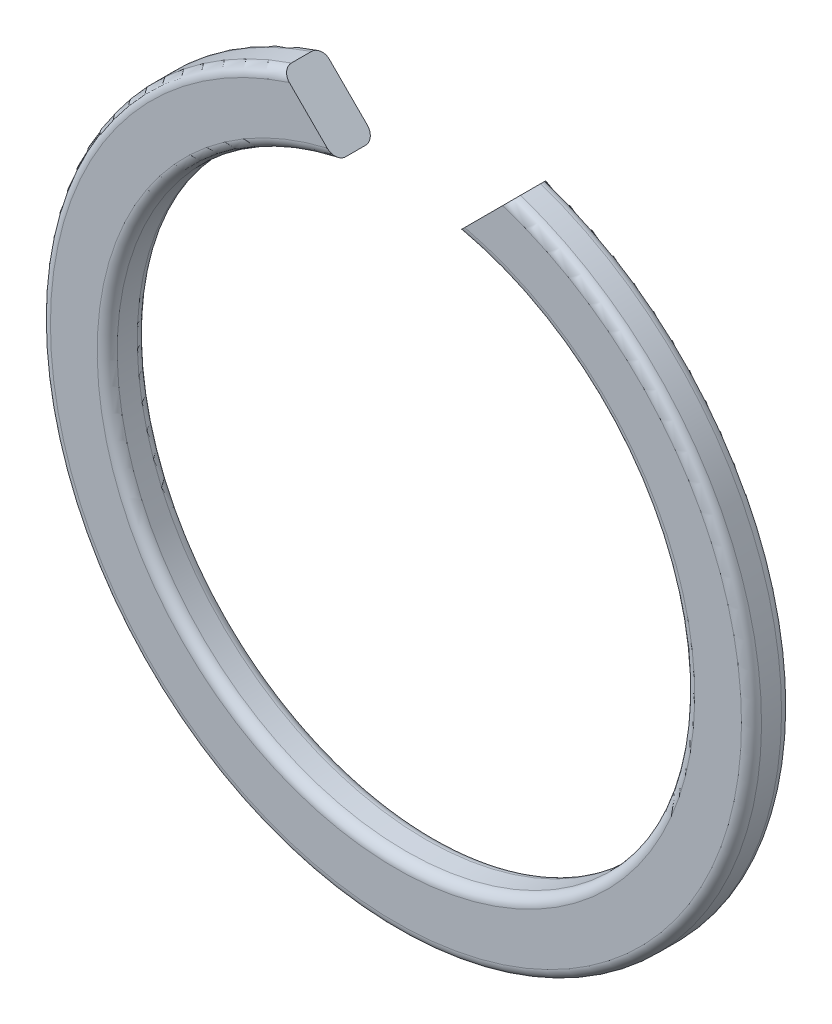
from build123d import *

# Parameters (mm, degrees)
BODYSKE_R      = 10.65
BODYSKE_R_2    = 8.65
BASEBODY_DEPTH = 1.2
SLIT_DEPTH     = 16.109103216
FILLET1_R      = 0.3


with BuildPart() as part:
    # BodySke → BaseBody (new body)
    with BuildSketch(Plane.XY):
        Circle(BODYSKE_R)
        Circle(BODYSKE_R_2, mode=Mode.SUBTRACT)
    extrude(amount=BASEBODY_DEPTH)

    # SlitSke → Slit (cut, through all)
    with BuildSketch(Plane.XY):
        Polygon((0, 6.65), (4, 10.65), (-4, 10.65), align=None)
    extrude(amount=SLIT_DEPTH, mode=Mode.SUBTRACT)

    # Fillet1
    fillet1_edges = [part.edges().sort_by_distance(p)[0] for p in [
        (0, -8.65, 1.2),
        (0, -8.65, 0),
        (0, -10.65, 1.2),
        (0, -10.65, 0),
    ]]
    fillet(fillet1_edges, radius=FILLET1_R)


solid = part.part
